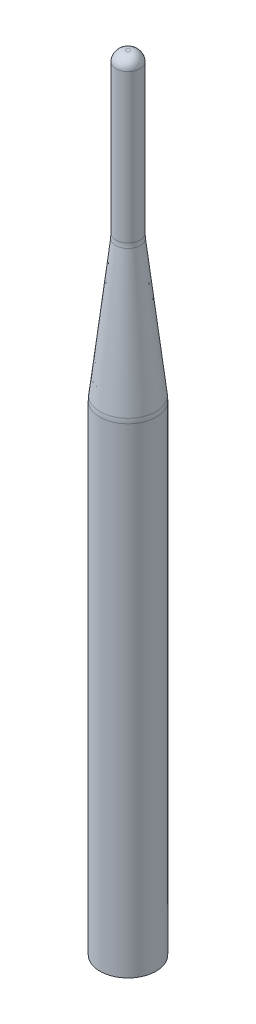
from build123d import *


with BuildPart() as part:
    # Sketch2 → Antenna (revolve)
    with BuildSketch(Plane.XY, mode=Mode.PRIVATE) as antenna_sk:
        with BuildLine():
            Line((3, 192.5), (3, 155.569574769))
            ThreePointArc((3, 155.569574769), (3.01618141, 155.000921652), (3.064673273, 154.434108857))
            Line((3.064673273, 154.434108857), (6.935326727, 120.565891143))
            ThreePointArc((6.935326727, 120.565891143), (6.98381859, 119.999078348), (7, 119.430425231))
            Line((7, 119.430425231), (7, 0))
            Line((7, 0), (0, 0))
            Line((0, 0), (0, 195))
            Line((0, 195), (0.5, 195))
            ThreePointArc((0.5, 195), (2.267766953, 194.267766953), (3, 192.5))
        make_face()
    revolve(antenna_sk.sketch.rotate(Axis((0, 0, 0), (0, 1, 0)), 90), axis=Axis((0, 0, 0), (0, 1, 0)))


solid = part.part
